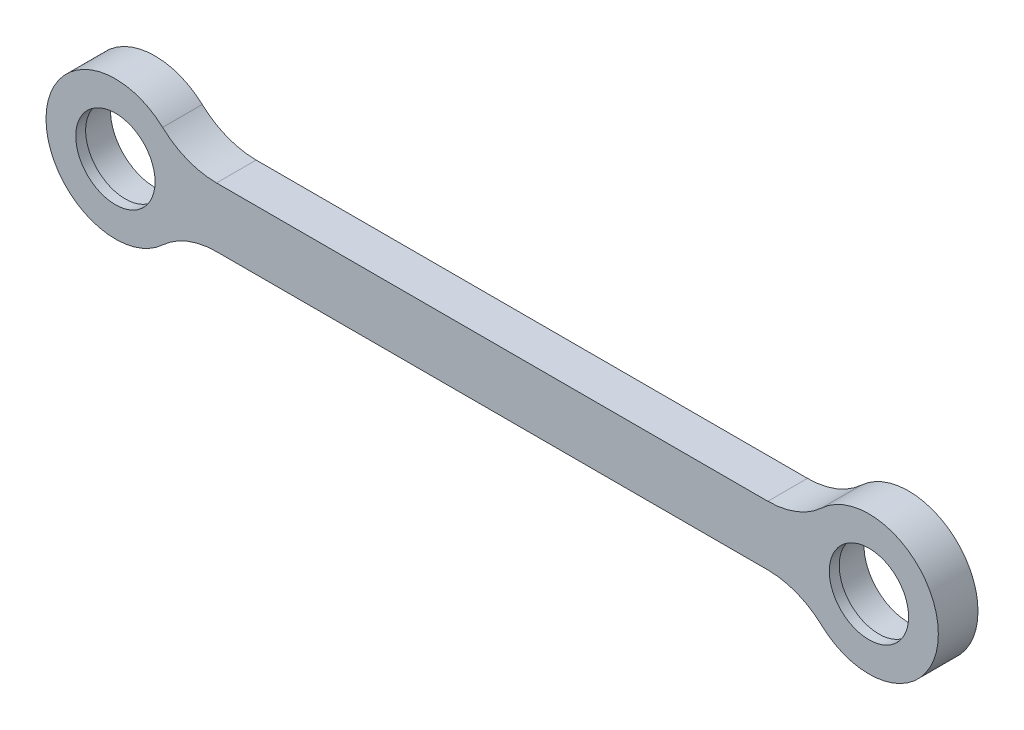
from build123d import *

# Parameters (mm, degrees)
SKETCH_1_R          = 2.1
EXTRUDE_1_DEPTH     = 4
FILLET_1_R          = 8
SKETCH_2_R          = 4.5
CUT_EXTRUDE_1_DEPTH = 4
SKETCH_3_R          = 4.5
SKETCH_3_R_2        = 4
EXTRUDE_2_DEPTH     = 1


with BuildPart() as part:
    # Sketch 1 → Extrude 1 (new body)
    with BuildSketch(Plane.XY):
        with BuildLine():
            Line((6.32455532, 3), (69.67544468, 3))
            ThreePointArc((69.67544468, 3), (83, 0), (69.67544468, -3))
            Line((69.67544468, -3), (6.32455532, -3))
            ThreePointArc((6.32455532, -3), (-7, 0), (6.32455532, 3))
        make_face()
        Circle(SKETCH_1_R, mode=Mode.SUBTRACT)
        with Locations((76, 0)):
            Circle(SKETCH_1_R, mode=Mode.SUBTRACT)
    extrude(amount=EXTRUDE_1_DEPTH)

    # Fillet 1
    fillet_1_edges = [part.edges().sort_by_distance(p)[0] for p in [
        (6.32455532, 3, 2),
        (69.67544468, 3, 2),
        (69.67544468, -3, 2),
        (6.32455532, -3, 2),
    ]]
    fillet(fillet_1_edges, radius=FILLET_1_R)

    # Sketch 2 → Cut-Extrude 1 (cut)
    with BuildSketch(Plane.XY.offset(4)):
        Circle(SKETCH_2_R)
        with Locations((76, 0)):
            Circle(SKETCH_2_R)
    extrude(amount=-CUT_EXTRUDE_1_DEPTH, mode=Mode.SUBTRACT)

    # Sketch 3 → Extrude 2 (add)
    # profile 1 of 2: a face of its own
    with BuildSketch(Plane.XY.offset(4)):
        with Locations((76, 0)):
            Circle(SKETCH_3_R)
        with Locations((76, 0)):
            Circle(SKETCH_3_R_2, mode=Mode.SUBTRACT)
    # profile 2 of 2: a face of its own
    with BuildSketch(Plane.XY.offset(4)):
        Circle(SKETCH_3_R)
        Circle(SKETCH_3_R_2, mode=Mode.SUBTRACT)
    extrude(amount=-EXTRUDE_2_DEPTH)


solid = part.part
